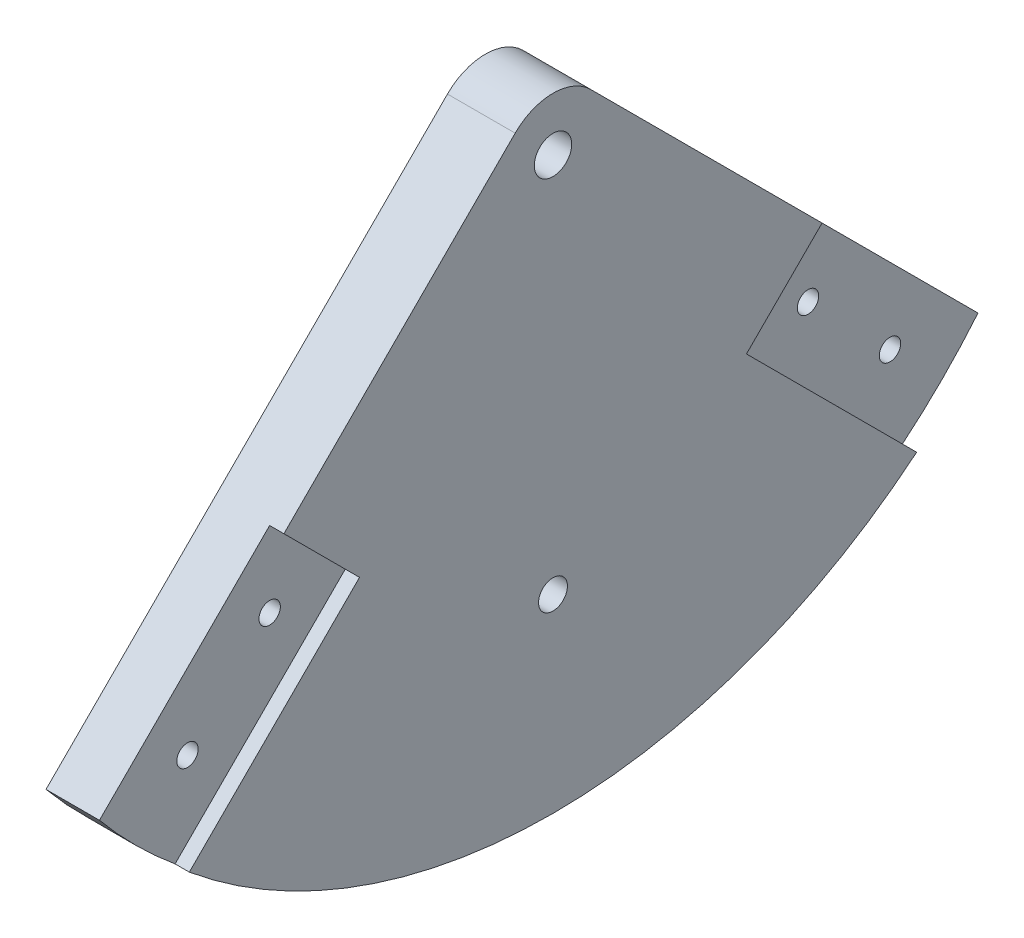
from build123d import *

# Parameters (mm, degrees)
SCHIZZO1_R                   = 4.05
SCHIZZO1_R_2                 = 5.25
SCHIZZO1_R_3                 = 3
ESTRUSIONE_ESTRUSIONE2_DEPTH = 19
TAGLIO_ESTRUSIONE2_DEPTH     = 4


with BuildPart() as part:
    # Schizzo1 → Estrusione-Estrusione2 (new body)
    with BuildSketch(Plane(origin=(0, 0, 0), x_dir=(0, 0, -1), z_dir=(1, 0, 0))):
        with BuildLine():
            Line((-10.608959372, 10.606536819), (-123.249468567, -102.033359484))
            ThreePointArc((-123.249468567, -102.033359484), (-0.000373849, -160.003494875), (123.248177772, -102.03220483))
            Line((123.248177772, -102.03220483), (10.606613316, 10.606636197))
            ThreePointArc((10.606613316, 10.606636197), (-0.001193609, 15.000429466), (-10.608959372, 10.606536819))
        make_face()
        with Locations((0, -106.767916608)):
            Circle(SCHIZZO1_R, mode=Mode.SUBTRACT)
        Circle(SCHIZZO1_R_2, mode=Mode.SUBTRACT)
        with Locations((-75.496996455, -75.49549885)):
            Circle(SCHIZZO1_R_3, mode=Mode.SUBTRACT)
        with Locations((75.550003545, -75.49549885)):
            Circle(SCHIZZO1_R_3, mode=Mode.SUBTRACT)
        with Locations((-98.553060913, -98.551727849)):
            Circle(SCHIZZO1_R_3, mode=Mode.SUBTRACT)
        with Locations((98.550394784, -98.551727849)):
            Circle(SCHIZZO1_R_3, mode=Mode.SUBTRACT)
    extrude(amount=-ESTRUSIONE_ESTRUSIONE2_DEPTH)

    # Schizzo4 → Taglio-Estrusione2 (cut)
    with BuildSketch(Plane(origin=(0, 0, 0), x_dir=(0, 0, -1), z_dir=(1, 0, 0))):
        with BuildLine():
            Line((102.034127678, -123.247012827), (54.283100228, -75.496300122))
            Line((54.283100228, -75.496300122), (75.497109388, -54.282290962))
            Line((75.497109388, -54.282290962), (123.248177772, -102.03220483))
            ThreePointArc((123.248177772, -102.03220483), (113.139494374, -113.137932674), (102.034127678, -123.247012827))
        make_face()
        with BuildLine():
            Line((-75.497645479, -54.281796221), (-123.24946849, -102.033359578))
            ThreePointArc((-123.24946849, -102.033359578), (-113.139794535, -113.139879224), (-102.033288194, -123.249567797))
            Line((-102.033288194, -123.249567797), (-54.283110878, -75.496317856))
            Line((-54.283110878, -75.496317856), (-75.497645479, -54.281796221))
        make_face()
    extrude(amount=-TAGLIO_ESTRUSIONE2_DEPTH, mode=Mode.SUBTRACT)


solid = part.part
